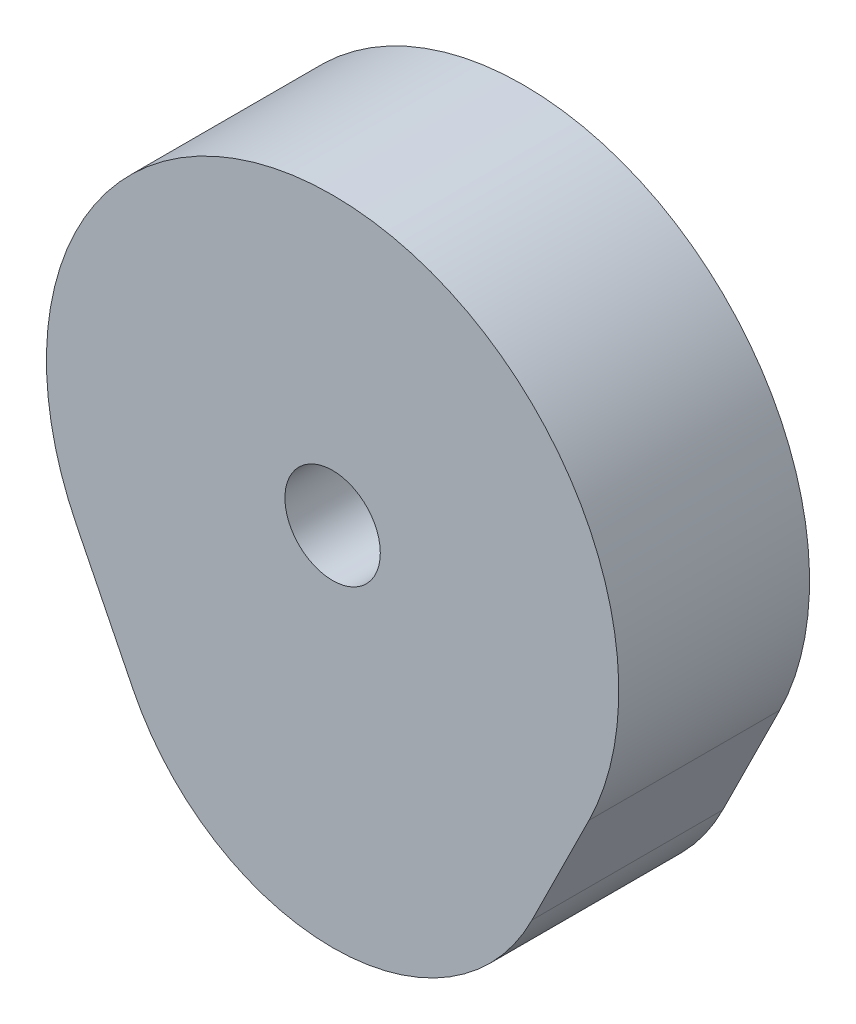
ISO-10303-21;
HEADER;
FILE_DESCRIPTION(('STEP AP214'),'2;1');
FILE_NAME('part.step','',(''),(''),'','','');
FILE_SCHEMA(('AUTOMOTIVE_DESIGN { 1 0 10303 214 1 1 1 1 }'));
ENDSEC;
DATA;
#1=APPLICATION_CONTEXT('core data for automotive mechanical design processes');
#2=APPLICATION_PROTOCOL_DEFINITION('international standard','automotive_design',2000,#1);
#3=PRODUCT_CONTEXT('',#1,'mechanical');
#4=PRODUCT('Part','Part','',(#3));
#5=PRODUCT_RELATED_PRODUCT_CATEGORY('part','',(#4));
#6=PRODUCT_DEFINITION_FORMATION('','',#4);
#7=PRODUCT_DEFINITION_CONTEXT('part definition',#1,'design');
#8=PRODUCT_DEFINITION('design','',#6,#7);
#9=PRODUCT_DEFINITION_SHAPE('','',#8);
#10=(LENGTH_UNIT() NAMED_UNIT(*) SI_UNIT(.MILLI.,.METRE.));
#11=(NAMED_UNIT(*) PLANE_ANGLE_UNIT() SI_UNIT($,.RADIAN.));
#12=(NAMED_UNIT(*) SI_UNIT($,.STERADIAN.) SOLID_ANGLE_UNIT());
#13=UNCERTAINTY_MEASURE_WITH_UNIT(LENGTH_MEASURE(1.E-05),#10,'distance_accuracy_value','');
#14=(GEOMETRIC_REPRESENTATION_CONTEXT(3) GLOBAL_UNCERTAINTY_ASSIGNED_CONTEXT((#13)) GLOBAL_UNIT_ASSIGNED_CONTEXT((#10,
#11,#12)) REPRESENTATION_CONTEXT('',''));
#15=CARTESIAN_POINT('',(0.,0.,0.));
#16=DIRECTION('',(0.,0.,1.));
#17=DIRECTION('',(1.,0.,0.));
#18=AXIS2_PLACEMENT_3D('',#15,#16,#17);
#19=CARTESIAN_POINT('',(8.06225774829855,-4.,-3.));
#20=DIRECTION('',(-0.895806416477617,0.444444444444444,0.));
#21=DIRECTION('',(-0.444444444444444,-0.895806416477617,0.));
#22=AXIS2_PLACEMENT_3D('',#19,#20,#21);
#23=PLANE('',#22);
#24=DIRECTION('',(0.,0.,1.));
#25=VECTOR('',#24,1.);
#26=CARTESIAN_POINT('',(8.06225774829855,-4.,-3.));
#27=LINE('',#26,#25);
#28=CARTESIAN_POINT('',(8.06225774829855,-4.,-3.));
#29=VERTEX_POINT('',#28);
#30=CARTESIAN_POINT('',(8.06225774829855,-4.,3.));
#31=VERTEX_POINT('',#30);
#32=EDGE_CURVE('E76',#29,#31,#27,.T.);
#33=ORIENTED_EDGE('',*,*,#32,.T.);
#34=DIRECTION('',(-0.444444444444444,-0.895806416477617,0.));
#35=VECTOR('',#34,1.);
#36=CARTESIAN_POINT('',(8.06225774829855,-4.,3.));
#37=LINE('',#36,#35);
#38=CARTESIAN_POINT('',(6.27064491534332,-7.61111111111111,3.));
#39=VERTEX_POINT('',#38);
#40=EDGE_CURVE('E117',#31,#39,#37,.T.);
#41=ORIENTED_EDGE('',*,*,#40,.T.);
#42=DIRECTION('',(0.,0.,1.));
#43=VECTOR('',#42,1.);
#44=CARTESIAN_POINT('',(6.27064491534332,-7.61111111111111,-3.));
#45=LINE('',#44,#43);
#46=CARTESIAN_POINT('',(6.27064491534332,-7.61111111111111,-3.));
#47=VERTEX_POINT('',#46);
#48=EDGE_CURVE('E12',#47,#39,#45,.T.);
#49=ORIENTED_EDGE('',*,*,#48,.F.);
#50=DIRECTION('',(-0.444444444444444,-0.895806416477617,0.));
#51=VECTOR('',#50,1.);
#52=CARTESIAN_POINT('',(8.06225774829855,-4.,-3.));
#53=LINE('',#52,#51);
#54=EDGE_CURVE('E131',#29,#47,#53,.T.);
#55=ORIENTED_EDGE('',*,*,#54,.F.);
#56=EDGE_LOOP('',(#33,#41,#49,#55));
#57=FACE_BOUND('',#56,.T.);
#58=ADVANCED_FACE('F62',(#57),#23,.F.);
#59=CARTESIAN_POINT('',(0.,-4.5,-3.));
#60=DIRECTION('',(0.,0.,1.));
#61=DIRECTION('',(1.,0.,0.));
#62=AXIS2_PLACEMENT_3D('',#59,#60,#61);
#63=CYLINDRICAL_SURFACE('',#62,7.);
#64=ORIENTED_EDGE('',*,*,#48,.T.);
#65=CARTESIAN_POINT('',(0.,-4.5,3.));
#66=DIRECTION('',(0.,0.,1.));
#67=DIRECTION('',(1.,0.,0.));
#68=AXIS2_PLACEMENT_3D('',#65,#66,#67);
#69=CIRCLE('',#68,7.);
#70=CARTESIAN_POINT('',(-6.27064491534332,-7.61111111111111,3.));
#71=VERTEX_POINT('',#70);
#72=EDGE_CURVE('E106',#71,#39,#69,.T.);
#73=ORIENTED_EDGE('',*,*,#72,.F.);
#74=DIRECTION('',(0.,0.,1.));
#75=VECTOR('',#74,1.);
#76=CARTESIAN_POINT('',(-6.27064491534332,-7.61111111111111,-3.));
#77=LINE('',#76,#75);
#78=CARTESIAN_POINT('',(-6.27064491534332,-7.61111111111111,-3.));
#79=VERTEX_POINT('',#78);
#80=EDGE_CURVE('E69',#79,#71,#77,.T.);
#81=ORIENTED_EDGE('',*,*,#80,.F.);
#82=CARTESIAN_POINT('',(0.,-4.5,-3.));
#83=DIRECTION('',(0.,0.,1.));
#84=DIRECTION('',(1.,0.,0.));
#85=AXIS2_PLACEMENT_3D('',#82,#83,#84);
#86=CIRCLE('',#85,7.);
#87=EDGE_CURVE('E108',#79,#47,#86,.T.);
#88=ORIENTED_EDGE('',*,*,#87,.T.);
#89=EDGE_LOOP('',(#64,#73,#81,#88));
#90=FACE_BOUND('',#89,.T.);
#91=ADVANCED_FACE('F105',(#90),#63,.T.);
#92=CARTESIAN_POINT('',(-8.06225774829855,-4.,-3.));
#93=DIRECTION('',(-0.895806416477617,-0.444444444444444,0.));
#94=DIRECTION('',(0.444444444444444,-0.895806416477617,0.));
#95=AXIS2_PLACEMENT_3D('',#92,#93,#94);
#96=PLANE('',#95);
#97=ORIENTED_EDGE('',*,*,#80,.T.);
#98=DIRECTION('',(0.444444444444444,-0.895806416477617,0.));
#99=VECTOR('',#98,1.);
#100=CARTESIAN_POINT('',(-8.06225774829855,-4.,3.));
#101=LINE('',#100,#99);
#102=CARTESIAN_POINT('',(-8.06225774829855,-4.,3.));
#103=VERTEX_POINT('',#102);
#104=EDGE_CURVE('E118',#103,#71,#101,.T.);
#105=ORIENTED_EDGE('',*,*,#104,.F.);
#106=DIRECTION('',(0.,0.,1.));
#107=VECTOR('',#106,1.);
#108=CARTESIAN_POINT('',(-8.06225774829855,-4.,-3.));
#109=LINE('',#108,#107);
#110=CARTESIAN_POINT('',(-8.06225774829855,-4.,-3.));
#111=VERTEX_POINT('',#110);
#112=EDGE_CURVE('E84',#111,#103,#109,.T.);
#113=ORIENTED_EDGE('',*,*,#112,.F.);
#114=DIRECTION('',(0.444444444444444,-0.895806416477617,0.));
#115=VECTOR('',#114,1.);
#116=CARTESIAN_POINT('',(-8.06225774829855,-4.,-3.));
#117=LINE('',#116,#115);
#118=EDGE_CURVE('E134',#111,#79,#117,.T.);
#119=ORIENTED_EDGE('',*,*,#118,.T.);
#120=EDGE_LOOP('',(#97,#105,#113,#119));
#121=FACE_BOUND('',#120,.T.);
#122=ADVANCED_FACE('F139',(#121),#96,.T.);
#123=CARTESIAN_POINT('',(0.,0.,-3.));
#124=DIRECTION('',(0.,0.,1.));
#125=DIRECTION('',(1.,0.,0.));
#126=AXIS2_PLACEMENT_3D('',#123,#124,#125);
#127=CYLINDRICAL_SURFACE('',#126,9.);
#128=ORIENTED_EDGE('',*,*,#112,.T.);
#129=CARTESIAN_POINT('',(0.,0.,3.));
#130=DIRECTION('',(0.,0.,1.));
#131=DIRECTION('',(1.,0.,0.));
#132=AXIS2_PLACEMENT_3D('',#129,#130,#131);
#133=CIRCLE('',#132,9.);
#134=EDGE_CURVE('E126',#31,#103,#133,.T.);
#135=ORIENTED_EDGE('',*,*,#134,.F.);
#136=ORIENTED_EDGE('',*,*,#32,.F.);
#137=CARTESIAN_POINT('',(0.,0.,-3.));
#138=DIRECTION('',(0.,0.,1.));
#139=DIRECTION('',(1.,0.,0.));
#140=AXIS2_PLACEMENT_3D('',#137,#138,#139);
#141=CIRCLE('',#140,9.);
#142=EDGE_CURVE('E136',#29,#111,#141,.T.);
#143=ORIENTED_EDGE('',*,*,#142,.T.);
#144=EDGE_LOOP('',(#128,#135,#136,#143));
#145=FACE_BOUND('',#144,.T.);
#146=ADVANCED_FACE('F143',(#145),#127,.T.);
#147=CARTESIAN_POINT('',(0.,-4.5,-3.));
#148=DIRECTION('',(0.,0.,1.));
#149=DIRECTION('',(1.,0.,0.));
#150=AXIS2_PLACEMENT_3D('',#147,#148,#149);
#151=PLANE('',#150);
#152=CARTESIAN_POINT('',(0.,0.,-3.));
#153=DIRECTION('',(0.,0.,1.));
#154=DIRECTION('',(1.,0.,0.));
#155=AXIS2_PLACEMENT_3D('',#152,#153,#154);
#156=CIRCLE('',#155,1.5);
#157=CARTESIAN_POINT('',(1.5,0.,-3.));
#158=VERTEX_POINT('',#157);
#159=EDGE_CURVE('E128',#158,#158,#156,.T.);
#160=ORIENTED_EDGE('',*,*,#159,.T.);
#161=EDGE_LOOP('',(#160));
#162=FACE_BOUND('',#161,.T.);
#163=ORIENTED_EDGE('',*,*,#54,.T.);
#164=ORIENTED_EDGE('',*,*,#87,.F.);
#165=ORIENTED_EDGE('',*,*,#118,.F.);
#166=ORIENTED_EDGE('',*,*,#142,.F.);
#167=EDGE_LOOP('',(#163,#164,#165,#166));
#168=FACE_BOUND('',#167,.T.);
#169=ADVANCED_FACE('F141',(#162,#168),#151,.F.);
#170=CARTESIAN_POINT('',(0.,0.,-3.));
#171=DIRECTION('',(0.,0.,1.));
#172=DIRECTION('',(1.,0.,0.));
#173=AXIS2_PLACEMENT_3D('',#170,#171,#172);
#174=CYLINDRICAL_SURFACE('',#173,1.5);
#175=ORIENTED_EDGE('',*,*,#159,.F.);
#176=EDGE_LOOP('',(#175));
#177=FACE_BOUND('',#176,.T.);
#178=CARTESIAN_POINT('',(0.,0.,3.));
#179=DIRECTION('',(0.,0.,1.));
#180=DIRECTION('',(1.,0.,0.));
#181=AXIS2_PLACEMENT_3D('',#178,#179,#180);
#182=CIRCLE('',#181,1.5);
#183=CARTESIAN_POINT('',(1.5,0.,3.));
#184=VERTEX_POINT('',#183);
#185=EDGE_CURVE('E120',#184,#184,#182,.T.);
#186=ORIENTED_EDGE('',*,*,#185,.T.);
#187=EDGE_LOOP('',(#186));
#188=FACE_BOUND('',#187,.T.);
#189=ADVANCED_FACE('F150',(#177,#188),#174,.F.);
#190=CARTESIAN_POINT('',(0.,-4.5,3.));
#191=DIRECTION('',(0.,0.,1.));
#192=DIRECTION('',(1.,0.,0.));
#193=AXIS2_PLACEMENT_3D('',#190,#191,#192);
#194=PLANE('',#193);
#195=ORIENTED_EDGE('',*,*,#40,.F.);
#196=ORIENTED_EDGE('',*,*,#134,.T.);
#197=ORIENTED_EDGE('',*,*,#104,.T.);
#198=ORIENTED_EDGE('',*,*,#72,.T.);
#199=EDGE_LOOP('',(#195,#196,#197,#198));
#200=FACE_BOUND('',#199,.T.);
#201=ORIENTED_EDGE('',*,*,#185,.F.);
#202=EDGE_LOOP('',(#201));
#203=FACE_BOUND('',#202,.T.);
#204=ADVANCED_FACE('F114',(#200,#203),#194,.T.);
#205=CLOSED_SHELL('',(#58,#91,#122,#146,#169,#189,#204));
#206=MANIFOLD_SOLID_BREP('B2',#205);
#207=ADVANCED_BREP_SHAPE_REPRESENTATION('',(#18,#206),#14);
#208=SHAPE_DEFINITION_REPRESENTATION(#9,#207);
ENDSEC;
END-ISO-10303-21;
